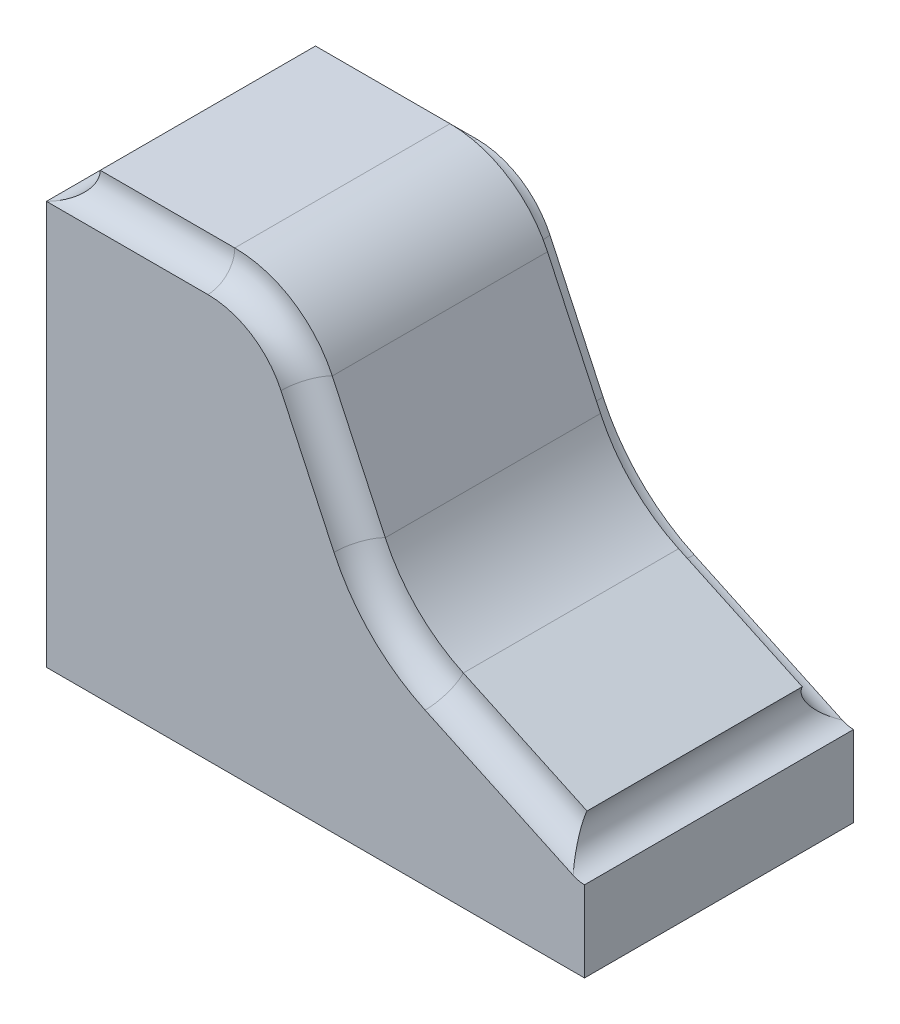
ISO-10303-21;
HEADER;
FILE_DESCRIPTION(('STEP AP214'),'2;1');
FILE_NAME('part.step','',(''),(''),'','','');
FILE_SCHEMA(('AUTOMOTIVE_DESIGN { 1 0 10303 214 1 1 1 1 }'));
ENDSEC;
DATA;
#1=APPLICATION_CONTEXT('core data for automotive mechanical design processes');
#2=APPLICATION_PROTOCOL_DEFINITION('international standard','automotive_design',2000,#1);
#3=PRODUCT_CONTEXT('',#1,'mechanical');
#4=PRODUCT('Part','Part','',(#3));
#5=PRODUCT_RELATED_PRODUCT_CATEGORY('part','',(#4));
#6=PRODUCT_DEFINITION_FORMATION('','',#4);
#7=PRODUCT_DEFINITION_CONTEXT('part definition',#1,'design');
#8=PRODUCT_DEFINITION('design','',#6,#7);
#9=PRODUCT_DEFINITION_SHAPE('','',#8);
#10=(LENGTH_UNIT() NAMED_UNIT(*) SI_UNIT(.MILLI.,.METRE.));
#11=(NAMED_UNIT(*) PLANE_ANGLE_UNIT() SI_UNIT($,.RADIAN.));
#12=(NAMED_UNIT(*) SI_UNIT($,.STERADIAN.) SOLID_ANGLE_UNIT());
#13=UNCERTAINTY_MEASURE_WITH_UNIT(LENGTH_MEASURE(1.E-05),#10,'distance_accuracy_value','');
#14=(GEOMETRIC_REPRESENTATION_CONTEXT(3) GLOBAL_UNCERTAINTY_ASSIGNED_CONTEXT((#13)) GLOBAL_UNIT_ASSIGNED_CONTEXT((#10,
#11,#12)) REPRESENTATION_CONTEXT('',''));
#15=CARTESIAN_POINT('',(0.,0.,0.));
#16=DIRECTION('',(0.,0.,1.));
#17=DIRECTION('',(1.,0.,0.));
#18=AXIS2_PLACEMENT_3D('',#15,#16,#17);
#19=CARTESIAN_POINT('',(0.,0.,63.5));
#20=DIRECTION('',(0.,1.,0.));
#21=DIRECTION('',(0.,0.,1.));
#22=AXIS2_PLACEMENT_3D('',#19,#20,#21);
#23=PLANE('',#22);
#24=DIRECTION('',(1.,0.,0.));
#25=VECTOR('',#24,1.);
#26=CARTESIAN_POINT('',(0.,0.,0.));
#27=LINE('',#26,#25);
#28=CARTESIAN_POINT('',(0.,0.,0.));
#29=VERTEX_POINT('',#28);
#30=CARTESIAN_POINT('',(127.,0.,0.));
#31=VERTEX_POINT('',#30);
#32=EDGE_CURVE('E172',#29,#31,#27,.T.);
#33=ORIENTED_EDGE('',*,*,#32,.T.);
#34=DIRECTION('',(0.,0.,-1.));
#35=VECTOR('',#34,1.);
#36=CARTESIAN_POINT('',(127.,0.,63.5));
#37=LINE('',#36,#35);
#38=CARTESIAN_POINT('',(127.,0.,63.5));
#39=VERTEX_POINT('',#38);
#40=EDGE_CURVE('E208',#39,#31,#37,.T.);
#41=ORIENTED_EDGE('',*,*,#40,.F.);
#42=DIRECTION('',(1.,0.,0.));
#43=VECTOR('',#42,1.);
#44=CARTESIAN_POINT('',(0.,0.,63.5));
#45=LINE('',#44,#43);
#46=CARTESIAN_POINT('',(0.,0.,63.5));
#47=VERTEX_POINT('',#46);
#48=EDGE_CURVE('E183',#47,#39,#45,.T.);
#49=ORIENTED_EDGE('',*,*,#48,.F.);
#50=DIRECTION('',(0.,0.,-1.));
#51=VECTOR('',#50,1.);
#52=CARTESIAN_POINT('',(0.,0.,63.5));
#53=LINE('',#52,#51);
#54=EDGE_CURVE('E191',#47,#29,#53,.T.);
#55=ORIENTED_EDGE('',*,*,#54,.T.);
#56=EDGE_LOOP('',(#33,#41,#49,#55));
#57=FACE_BOUND('',#56,.T.);
#58=ADVANCED_FACE('F44',(#57),#23,.F.);
#59=CARTESIAN_POINT('',(127.,0.,63.5));
#60=DIRECTION('',(-1.,0.,0.));
#61=DIRECTION('',(0.,0.,1.));
#62=AXIS2_PLACEMENT_3D('',#59,#60,#61);
#63=PLANE('',#62);
#64=DIRECTION('',(0.,1.,0.));
#65=VECTOR('',#64,1.);
#66=CARTESIAN_POINT('',(127.,0.,0.));
#67=LINE('',#66,#65);
#68=CARTESIAN_POINT('',(127.,19.05,0.));
#69=VERTEX_POINT('',#68);
#70=EDGE_CURVE('E176',#31,#69,#67,.T.);
#71=ORIENTED_EDGE('',*,*,#70,.T.);
#72=DIRECTION('',(0.,0.,1.));
#73=VECTOR('',#72,1.);
#74=CARTESIAN_POINT('',(127.,19.05,-14.0700000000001));
#75=LINE('',#74,#73);
#76=CARTESIAN_POINT('',(127.,19.05,63.5));
#77=VERTEX_POINT('',#76);
#78=EDGE_CURVE('E270',#69,#77,#75,.T.);
#79=ORIENTED_EDGE('',*,*,#78,.T.);
#80=DIRECTION('',(0.,1.,0.));
#81=VECTOR('',#80,1.);
#82=CARTESIAN_POINT('',(127.,0.,63.5));
#83=LINE('',#82,#81);
#84=EDGE_CURVE('E186',#39,#77,#83,.T.);
#85=ORIENTED_EDGE('',*,*,#84,.F.);
#86=ORIENTED_EDGE('',*,*,#40,.T.);
#87=EDGE_LOOP('',(#71,#79,#85,#86));
#88=FACE_BOUND('',#87,.T.);
#89=ADVANCED_FACE('F353',(#88),#63,.F.);
#90=CARTESIAN_POINT('',(0.,0.,63.5));
#91=DIRECTION('',(1.,0.,0.));
#92=DIRECTION('',(0.,0.,-1.));
#93=AXIS2_PLACEMENT_3D('',#90,#91,#92);
#94=PLANE('',#93);
#95=DIRECTION('',(0.,-1.,0.));
#96=VECTOR('',#95,1.);
#97=CARTESIAN_POINT('',(0.,0.,63.5));
#98=LINE('',#97,#96);
#99=CARTESIAN_POINT('',(0.,95.25,63.5));
#100=VERTEX_POINT('',#99);
#101=EDGE_CURVE('E190',#100,#47,#98,.T.);
#102=ORIENTED_EDGE('',*,*,#101,.F.);
#103=DIRECTION('',(0.,0.,-1.));
#104=VECTOR('',#103,1.);
#105=CARTESIAN_POINT('',(0.,95.25,77.5700000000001));
#106=LINE('',#105,#104);
#107=CARTESIAN_POINT('',(0.,95.25,0.));
#108=VERTEX_POINT('',#107);
#109=EDGE_CURVE('E249',#100,#108,#106,.T.);
#110=ORIENTED_EDGE('',*,*,#109,.T.);
#111=DIRECTION('',(0.,-1.,0.));
#112=VECTOR('',#111,1.);
#113=CARTESIAN_POINT('',(0.,0.,0.));
#114=LINE('',#113,#112);
#115=EDGE_CURVE('E187',#108,#29,#114,.T.);
#116=ORIENTED_EDGE('',*,*,#115,.T.);
#117=ORIENTED_EDGE('',*,*,#54,.F.);
#118=EDGE_LOOP('',(#102,#110,#116,#117));
#119=FACE_BOUND('',#118,.T.);
#120=ADVANCED_FACE('F334',(#119),#94,.F.);
#121=CARTESIAN_POINT('',(108.151485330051,76.2279054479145,63.5));
#122=DIRECTION('',(0.,0.,-1.));
#123=DIRECTION('',(-1.,0.,0.));
#124=AXIS2_PLACEMENT_3D('',#121,#122,#123);
#125=PLANE('',#124);
#126=ORIENTED_EDGE('',*,*,#84,.T.);
#127=CARTESIAN_POINT('',(127.,25.4,63.5));
#128=DIRECTION('',(0.,0.,-1.));
#129=DIRECTION('',(-1.,0.,0.));
#130=AXIS2_PLACEMENT_3D('',#127,#128,#129);
#131=CIRCLE('',#130,6.35);
#132=CARTESIAN_POINT('',(124.316374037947,19.6449455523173,63.5));
#133=VERTEX_POINT('',#132);
#134=EDGE_CURVE('E159',#77,#133,#131,.T.);
#135=ORIENTED_EDGE('',*,*,#134,.T.);
#136=DIRECTION('',(-0.906307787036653,0.422618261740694,0.));
#137=VECTOR('',#136,1.);
#138=CARTESIAN_POINT('',(137.068124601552,13.6987066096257,63.5));
#139=LINE('',#138,#137);
#140=CARTESIAN_POINT('',(89.3661035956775,35.9425243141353,63.5));
#141=VERTEX_POINT('',#140);
#142=EDGE_CURVE('E12',#133,#141,#139,.T.);
#143=ORIENTED_EDGE('',*,*,#142,.T.);
#144=CARTESIAN_POINT('',(108.151485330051,76.2279054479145,63.5));
#145=DIRECTION('',(0.,0.,-1.));
#146=DIRECTION('',(-1.,0.,0.));
#147=AXIS2_PLACEMENT_3D('',#144,#145,#146);
#148=CIRCLE('',#147,44.45);
#149=CARTESIAN_POINT('',(67.8661041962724,57.4425237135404,63.5));
#150=VERTEX_POINT('',#149);
#151=EDGE_CURVE('E51',#141,#150,#148,.T.);
#152=ORIENTED_EDGE('',*,*,#151,.T.);
#153=DIRECTION('',(-0.4226182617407,0.906307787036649,0.));
#154=VECTOR('',#153,1.);
#155=CARTESIAN_POINT('',(67.8661041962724,57.4425237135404,63.5));
#156=LINE('',#155,#154);
#157=CARTESIAN_POINT('',(55.3651633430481,84.2508778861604,63.5));
#158=VERTEX_POINT('',#157);
#159=EDGE_CURVE('E229',#150,#158,#156,.T.);
#160=ORIENTED_EDGE('',*,*,#159,.T.);
#161=CARTESIAN_POINT('',(38.1,76.2,63.5));
#162=DIRECTION('',(0.,0.,1.));
#163=DIRECTION('',(1.,0.,0.));
#164=AXIS2_PLACEMENT_3D('',#161,#162,#163);
#165=CIRCLE('',#164,19.05);
#166=CARTESIAN_POINT('',(38.0999999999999,95.25,63.5));
#167=VERTEX_POINT('',#166);
#168=EDGE_CURVE('E226',#158,#167,#165,.T.);
#169=ORIENTED_EDGE('',*,*,#168,.T.);
#170=DIRECTION('',(-1.,0.,0.));
#171=VECTOR('',#170,1.);
#172=CARTESIAN_POINT('',(38.1,95.25,63.5));
#173=LINE('',#172,#171);
#174=EDGE_CURVE('E223',#167,#100,#173,.T.);
#175=ORIENTED_EDGE('',*,*,#174,.T.);
#176=ORIENTED_EDGE('',*,*,#101,.T.);
#177=ORIENTED_EDGE('',*,*,#48,.T.);
#178=EDGE_LOOP('',(#126,#135,#143,#152,#160,#169,#175,#176,#177));
#179=FACE_BOUND('',#178,.T.);
#180=ADVANCED_FACE('F233',(#179),#125,.F.);
#181=CARTESIAN_POINT('',(108.151485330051,76.2279054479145,0.));
#182=DIRECTION('',(0.,0.,-1.));
#183=DIRECTION('',(-1.,0.,0.));
#184=AXIS2_PLACEMENT_3D('',#181,#182,#183);
#185=PLANE('',#184);
#186=CARTESIAN_POINT('',(127.,25.4,0.));
#187=DIRECTION('',(0.,0.,-1.));
#188=DIRECTION('',(-1.,0.,0.));
#189=AXIS2_PLACEMENT_3D('',#186,#187,#188);
#190=CIRCLE('',#189,6.35);
#191=CARTESIAN_POINT('',(124.316374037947,19.6449455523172,0.));
#192=VERTEX_POINT('',#191);
#193=EDGE_CURVE('E221',#69,#192,#190,.T.);
#194=ORIENTED_EDGE('',*,*,#193,.F.);
#195=ORIENTED_EDGE('',*,*,#70,.F.);
#196=ORIENTED_EDGE('',*,*,#32,.F.);
#197=ORIENTED_EDGE('',*,*,#115,.F.);
#198=DIRECTION('',(1.,0.,0.));
#199=VECTOR('',#198,1.);
#200=CARTESIAN_POINT('',(-14.0700000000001,95.25,0.));
#201=LINE('',#200,#199);
#202=CARTESIAN_POINT('',(38.1000000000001,95.25,0.));
#203=VERTEX_POINT('',#202);
#204=EDGE_CURVE('E219',#203,#108,#201,.F.);
#205=ORIENTED_EDGE('',*,*,#204,.F.);
#206=CARTESIAN_POINT('',(38.1,76.2,0.));
#207=DIRECTION('',(0.,0.,1.));
#208=DIRECTION('',(1.,0.,0.));
#209=AXIS2_PLACEMENT_3D('',#206,#207,#208);
#210=CIRCLE('',#209,19.05);
#211=CARTESIAN_POINT('',(55.3651633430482,84.2508778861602,0.));
#212=VERTEX_POINT('',#211);
#213=EDGE_CURVE('E217',#212,#203,#210,.T.);
#214=ORIENTED_EDGE('',*,*,#213,.F.);
#215=DIRECTION('',(0.4226182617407,-0.906307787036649,0.));
#216=VECTOR('',#215,1.);
#217=CARTESIAN_POINT('',(55.3651633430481,84.2508778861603,0.));
#218=LINE('',#217,#216);
#219=CARTESIAN_POINT('',(67.8661041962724,57.4425237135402,0.));
#220=VERTEX_POINT('',#219);
#221=EDGE_CURVE('E215',#220,#212,#218,.F.);
#222=ORIENTED_EDGE('',*,*,#221,.F.);
#223=CARTESIAN_POINT('',(108.151485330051,76.2279054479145,0.));
#224=DIRECTION('',(0.,0.,-1.));
#225=DIRECTION('',(-1.,0.,0.));
#226=AXIS2_PLACEMENT_3D('',#223,#224,#225);
#227=CIRCLE('',#226,44.45);
#228=CARTESIAN_POINT('',(89.3661035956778,35.9425243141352,0.));
#229=VERTEX_POINT('',#228);
#230=EDGE_CURVE('E213',#229,#220,#227,.T.);
#231=ORIENTED_EDGE('',*,*,#230,.F.);
#232=DIRECTION('',(0.906307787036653,-0.422618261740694,0.));
#233=VECTOR('',#232,1.);
#234=CARTESIAN_POINT('',(89.3661035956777,35.9425243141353,0.));
#235=LINE('',#234,#233);
#236=EDGE_CURVE('E211',#192,#229,#235,.F.);
#237=ORIENTED_EDGE('',*,*,#236,.F.);
#238=EDGE_LOOP('',(#194,#195,#196,#197,#205,#214,#222,#231,#237));
#239=FACE_BOUND('',#238,.T.);
#240=ADVANCED_FACE('F328',(#239),#185,.T.);
#241=CARTESIAN_POINT('',(139.751750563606,19.4537610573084,63.5));
#242=DIRECTION('',(-0.906307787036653,0.422618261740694,0.));
#243=DIRECTION('',(-0.422618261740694,-0.906307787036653,0.));
#244=AXIS2_PLACEMENT_3D('',#241,#242,#243);
#245=CYLINDRICAL_SURFACE('',#244,6.35);
#246=CARTESIAN_POINT('',(92.049729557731,41.697578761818,63.5));
#247=DIRECTION('',(-0.906307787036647,0.422618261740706,0.));
#248=DIRECTION('',(0.422618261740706,0.906307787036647,0.));
#249=AXIS2_PLACEMENT_3D('',#246,#247,#248);
#250=CIRCLE('',#249,6.35);
#251=CARTESIAN_POINT('',(92.049729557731,41.697578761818,57.15));
#252=VERTEX_POINT('',#251);
#253=EDGE_CURVE('E237',#252,#141,#250,.T.);
#254=ORIENTED_EDGE('',*,*,#253,.T.);
#255=ORIENTED_EDGE('',*,*,#142,.F.);
#256=CARTESIAN_POINT('',(127.,25.4,63.5));
#257=DIRECTION('',(-0.64085638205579,0.298836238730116,0.707106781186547));
#258=DIRECTION('',(-0.64085638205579,0.298836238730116,-0.707106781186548));
#259=AXIS2_PLACEMENT_3D('',#256,#257,#258);
#260=ELLIPSE('',#259,8.98025612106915,6.35);
#261=CARTESIAN_POINT('',(121.244945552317,28.0836259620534,57.15));
#262=VERTEX_POINT('',#261);
#263=EDGE_CURVE('E153',#133,#262,#260,.F.);
#264=ORIENTED_EDGE('',*,*,#263,.T.);
#265=DIRECTION('',(-0.906307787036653,0.422618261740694,0.));
#266=VECTOR('',#265,1.);
#267=CARTESIAN_POINT('',(139.751750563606,19.4537610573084,57.15));
#268=LINE('',#267,#266);
#269=EDGE_CURVE('E164',#252,#262,#268,.F.);
#270=ORIENTED_EDGE('',*,*,#269,.F.);
#271=EDGE_LOOP('',(#254,#255,#264,#270));
#272=FACE_BOUND('',#271,.T.);
#273=ADVANCED_FACE('F163',(#272),#245,.F.);
#274=CARTESIAN_POINT('',(108.151485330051,76.2279054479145,63.5));
#275=DIRECTION('',(0.,0.,-1.));
#276=DIRECTION('',(-1.,0.,0.));
#277=AXIS2_PLACEMENT_3D('',#274,#275,#276);
#278=TOROIDAL_SURFACE('',#277,38.1,6.35);
#279=CARTESIAN_POINT('',(73.6211586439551,60.1261496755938,63.5));
#280=DIRECTION('',(-0.422618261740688,0.906307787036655,0.));
#281=DIRECTION('',(0.906307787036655,0.422618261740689,0.));
#282=AXIS2_PLACEMENT_3D('',#279,#280,#281);
#283=CIRCLE('',#282,6.35);
#284=CARTESIAN_POINT('',(73.6211586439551,60.1261496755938,57.15));
#285=VERTEX_POINT('',#284);
#286=EDGE_CURVE('E239',#285,#150,#283,.T.);
#287=ORIENTED_EDGE('',*,*,#286,.T.);
#288=ORIENTED_EDGE('',*,*,#151,.F.);
#289=ORIENTED_EDGE('',*,*,#253,.F.);
#290=CARTESIAN_POINT('',(108.151485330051,76.2279054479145,57.15));
#291=DIRECTION('',(0.,0.,1.));
#292=DIRECTION('',(1.,0.,0.));
#293=AXIS2_PLACEMENT_3D('',#290,#291,#292);
#294=CIRCLE('',#293,38.1);
#295=EDGE_CURVE('E173',#285,#252,#294,.T.);
#296=ORIENTED_EDGE('',*,*,#295,.F.);
#297=EDGE_LOOP('',(#287,#288,#289,#296));
#298=FACE_BOUND('',#297,.T.);
#299=ADVANCED_FACE('F236',(#298),#278,.F.);
#300=CARTESIAN_POINT('',(73.6211586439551,60.1261496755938,63.5));
#301=DIRECTION('',(-0.4226182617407,0.906307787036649,0.));
#302=DIRECTION('',(-0.906307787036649,-0.4226182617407,0.));
#303=AXIS2_PLACEMENT_3D('',#300,#301,#302);
#304=CYLINDRICAL_SURFACE('',#303,6.35);
#305=CARTESIAN_POINT('',(61.1202177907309,86.9345038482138,63.5));
#306=DIRECTION('',(-0.422618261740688,0.906307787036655,0.));
#307=DIRECTION('',(0.906307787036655,0.422618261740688,0.));
#308=AXIS2_PLACEMENT_3D('',#305,#306,#307);
#309=CIRCLE('',#308,6.35);
#310=CARTESIAN_POINT('',(61.1202177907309,86.9345038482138,57.15));
#311=VERTEX_POINT('',#310);
#312=EDGE_CURVE('E241',#311,#158,#309,.T.);
#313=ORIENTED_EDGE('',*,*,#312,.T.);
#314=ORIENTED_EDGE('',*,*,#159,.F.);
#315=ORIENTED_EDGE('',*,*,#286,.F.);
#316=DIRECTION('',(-0.4226182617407,0.906307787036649,0.));
#317=VECTOR('',#316,1.);
#318=CARTESIAN_POINT('',(73.6211586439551,60.1261496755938,57.15));
#319=LINE('',#318,#317);
#320=EDGE_CURVE('E179',#311,#285,#319,.F.);
#321=ORIENTED_EDGE('',*,*,#320,.F.);
#322=EDGE_LOOP('',(#313,#314,#315,#321));
#323=FACE_BOUND('',#322,.T.);
#324=ADVANCED_FACE('F343',(#323),#304,.F.);
#325=CARTESIAN_POINT('',(38.1,76.2,63.5));
#326=DIRECTION('',(0.,0.,1.));
#327=DIRECTION('',(1.,0.,0.));
#328=AXIS2_PLACEMENT_3D('',#325,#326,#327);
#329=TOROIDAL_SURFACE('',#328,25.4,6.35);
#330=CARTESIAN_POINT('',(38.1,101.6,63.5));
#331=DIRECTION('',(-1.,0.,0.));
#332=DIRECTION('',(0.,1.,0.));
#333=AXIS2_PLACEMENT_3D('',#330,#331,#332);
#334=CIRCLE('',#333,6.35);
#335=CARTESIAN_POINT('',(38.1,101.6,57.15));
#336=VERTEX_POINT('',#335);
#337=EDGE_CURVE('E166',#336,#167,#334,.T.);
#338=ORIENTED_EDGE('',*,*,#337,.T.);
#339=ORIENTED_EDGE('',*,*,#168,.F.);
#340=ORIENTED_EDGE('',*,*,#312,.F.);
#341=CARTESIAN_POINT('',(38.1,76.2,57.15));
#342=DIRECTION('',(0.,0.,1.));
#343=DIRECTION('',(1.,0.,0.));
#344=AXIS2_PLACEMENT_3D('',#341,#342,#343);
#345=CIRCLE('',#344,25.4);
#346=EDGE_CURVE('E276',#336,#311,#345,.F.);
#347=ORIENTED_EDGE('',*,*,#346,.F.);
#348=EDGE_LOOP('',(#338,#339,#340,#347));
#349=FACE_BOUND('',#348,.T.);
#350=ADVANCED_FACE('F342',(#349),#329,.F.);
#351=CARTESIAN_POINT('',(38.1,101.6,63.5));
#352=DIRECTION('',(-1.,0.,0.));
#353=DIRECTION('',(0.,0.,1.));
#354=AXIS2_PLACEMENT_3D('',#351,#352,#353);
#355=CYLINDRICAL_SURFACE('',#354,6.35);
#356=CARTESIAN_POINT('',(0.,101.6,63.5));
#357=DIRECTION('',(-0.707106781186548,0.,-0.707106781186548));
#358=DIRECTION('',(0.707106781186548,0.,-0.707106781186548));
#359=AXIS2_PLACEMENT_3D('',#356,#357,#358);
#360=ELLIPSE('',#359,8.98025612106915,6.35);
#361=CARTESIAN_POINT('',(6.35,101.6,57.15));
#362=VERTEX_POINT('',#361);
#363=EDGE_CURVE('E58',#100,#362,#360,.F.);
#364=ORIENTED_EDGE('',*,*,#363,.F.);
#365=ORIENTED_EDGE('',*,*,#174,.F.);
#366=ORIENTED_EDGE('',*,*,#337,.F.);
#367=DIRECTION('',(-1.,0.,0.));
#368=VECTOR('',#367,1.);
#369=CARTESIAN_POINT('',(38.1,101.6,57.15));
#370=LINE('',#369,#368);
#371=EDGE_CURVE('E158',#362,#336,#370,.F.);
#372=ORIENTED_EDGE('',*,*,#371,.F.);
#373=EDGE_LOOP('',(#364,#365,#366,#372));
#374=FACE_BOUND('',#373,.T.);
#375=ADVANCED_FACE('F340',(#374),#355,.F.);
#376=CARTESIAN_POINT('',(127.,25.4,-14.0700000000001));
#377=DIRECTION('',(0.,0.,1.));
#378=DIRECTION('',(1.,0.,0.));
#379=AXIS2_PLACEMENT_3D('',#376,#377,#378);
#380=CYLINDRICAL_SURFACE('',#379,6.35);
#381=ORIENTED_EDGE('',*,*,#263,.F.);
#382=ORIENTED_EDGE('',*,*,#134,.F.);
#383=ORIENTED_EDGE('',*,*,#78,.F.);
#384=ORIENTED_EDGE('',*,*,#193,.T.);
#385=CARTESIAN_POINT('',(127.,25.4,0.));
#386=DIRECTION('',(0.64085638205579,-0.298836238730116,0.707106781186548));
#387=DIRECTION('',(0.640856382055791,-0.298836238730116,-0.707106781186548));
#388=AXIS2_PLACEMENT_3D('',#385,#386,#387);
#389=ELLIPSE('',#388,8.98025612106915,6.35);
#390=CARTESIAN_POINT('',(121.244945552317,28.0836259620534,6.34999999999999));
#391=VERTEX_POINT('',#390);
#392=EDGE_CURVE('E66',#192,#391,#389,.F.);
#393=ORIENTED_EDGE('',*,*,#392,.T.);
#394=DIRECTION('',(0.,0.,1.));
#395=VECTOR('',#394,1.);
#396=CARTESIAN_POINT('',(121.244945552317,28.0836259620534,-14.0700000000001));
#397=LINE('',#396,#395);
#398=EDGE_CURVE('E150',#262,#391,#397,.F.);
#399=ORIENTED_EDGE('',*,*,#398,.F.);
#400=EDGE_LOOP('',(#381,#382,#383,#384,#393,#399));
#401=FACE_BOUND('',#400,.T.);
#402=ADVANCED_FACE('F152',(#401),#380,.F.);
#403=CARTESIAN_POINT('',(-14.0700000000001,101.6,0.));
#404=DIRECTION('',(1.,0.,0.));
#405=DIRECTION('',(0.,0.,-1.));
#406=AXIS2_PLACEMENT_3D('',#403,#404,#405);
#407=CYLINDRICAL_SURFACE('',#406,6.35);
#408=CARTESIAN_POINT('',(38.1,101.6,0.));
#409=DIRECTION('',(1.,0.,0.));
#410=DIRECTION('',(0.,1.,0.));
#411=AXIS2_PLACEMENT_3D('',#408,#409,#410);
#412=CIRCLE('',#411,6.35);
#413=CARTESIAN_POINT('',(38.1,101.6,6.34999999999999));
#414=VERTEX_POINT('',#413);
#415=EDGE_CURVE('E303',#414,#203,#412,.T.);
#416=ORIENTED_EDGE('',*,*,#415,.T.);
#417=ORIENTED_EDGE('',*,*,#204,.T.);
#418=CARTESIAN_POINT('',(0.,101.6,0.));
#419=DIRECTION('',(0.707106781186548,0.,-0.707106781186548));
#420=DIRECTION('',(-0.707106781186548,0.,-0.707106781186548));
#421=AXIS2_PLACEMENT_3D('',#418,#419,#420);
#422=ELLIPSE('',#421,8.98025612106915,6.35);
#423=CARTESIAN_POINT('',(6.35,101.6,6.34999999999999));
#424=VERTEX_POINT('',#423);
#425=EDGE_CURVE('E253',#108,#424,#422,.F.);
#426=ORIENTED_EDGE('',*,*,#425,.T.);
#427=DIRECTION('',(1.,0.,0.));
#428=VECTOR('',#427,1.);
#429=CARTESIAN_POINT('',(-14.0700000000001,101.6,6.34999999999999));
#430=LINE('',#429,#428);
#431=EDGE_CURVE('E267',#414,#424,#430,.F.);
#432=ORIENTED_EDGE('',*,*,#431,.F.);
#433=EDGE_LOOP('',(#416,#417,#426,#432));
#434=FACE_BOUND('',#433,.T.);
#435=ADVANCED_FACE('F313',(#434),#407,.F.);
#436=CARTESIAN_POINT('',(38.1,76.2,0.));
#437=DIRECTION('',(0.,0.,-1.));
#438=DIRECTION('',(-1.,0.,0.));
#439=AXIS2_PLACEMENT_3D('',#436,#437,#438);
#440=TOROIDAL_SURFACE('',#439,25.4,6.35);
#441=CARTESIAN_POINT('',(61.1202177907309,86.9345038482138,0.));
#442=DIRECTION('',(0.422618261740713,-0.906307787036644,0.));
#443=DIRECTION('',(0.906307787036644,0.422618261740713,0.));
#444=AXIS2_PLACEMENT_3D('',#441,#442,#443);
#445=CIRCLE('',#444,6.35);
#446=CARTESIAN_POINT('',(61.1202177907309,86.9345038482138,6.34999999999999));
#447=VERTEX_POINT('',#446);
#448=EDGE_CURVE('E300',#447,#212,#445,.T.);
#449=ORIENTED_EDGE('',*,*,#448,.T.);
#450=ORIENTED_EDGE('',*,*,#213,.T.);
#451=ORIENTED_EDGE('',*,*,#415,.F.);
#452=CARTESIAN_POINT('',(38.1,76.2,6.34999999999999));
#453=DIRECTION('',(0.,0.,-1.));
#454=DIRECTION('',(-1.,0.,0.));
#455=AXIS2_PLACEMENT_3D('',#452,#453,#454);
#456=CIRCLE('',#455,25.4);
#457=EDGE_CURVE('E264',#447,#414,#456,.F.);
#458=ORIENTED_EDGE('',*,*,#457,.F.);
#459=EDGE_LOOP('',(#449,#450,#451,#458));
#460=FACE_BOUND('',#459,.T.);
#461=ADVANCED_FACE('F321',(#460),#440,.F.);
#462=CARTESIAN_POINT('',(61.1202177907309,86.9345038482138,0.));
#463=DIRECTION('',(0.4226182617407,-0.906307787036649,0.));
#464=DIRECTION('',(0.906307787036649,0.4226182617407,0.));
#465=AXIS2_PLACEMENT_3D('',#462,#463,#464);
#466=CYLINDRICAL_SURFACE('',#465,6.35);
#467=CARTESIAN_POINT('',(73.6211586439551,60.1261496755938,0.));
#468=DIRECTION('',(0.422618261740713,-0.906307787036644,0.));
#469=DIRECTION('',(0.906307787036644,0.422618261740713,0.));
#470=AXIS2_PLACEMENT_3D('',#467,#468,#469);
#471=CIRCLE('',#470,6.35);
#472=CARTESIAN_POINT('',(73.6211586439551,60.1261496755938,6.34999999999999));
#473=VERTEX_POINT('',#472);
#474=EDGE_CURVE('E295',#473,#220,#471,.T.);
#475=ORIENTED_EDGE('',*,*,#474,.T.);
#476=ORIENTED_EDGE('',*,*,#221,.T.);
#477=ORIENTED_EDGE('',*,*,#448,.F.);
#478=DIRECTION('',(0.4226182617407,-0.906307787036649,0.));
#479=VECTOR('',#478,1.);
#480=CARTESIAN_POINT('',(61.1202177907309,86.9345038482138,6.34999999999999));
#481=LINE('',#480,#479);
#482=EDGE_CURVE('E261',#473,#447,#481,.F.);
#483=ORIENTED_EDGE('',*,*,#482,.F.);
#484=EDGE_LOOP('',(#475,#476,#477,#483));
#485=FACE_BOUND('',#484,.T.);
#486=ADVANCED_FACE('F324',(#485),#466,.F.);
#487=CARTESIAN_POINT('',(108.151485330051,76.2279054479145,0.));
#488=DIRECTION('',(0.,0.,1.));
#489=DIRECTION('',(1.,0.,0.));
#490=AXIS2_PLACEMENT_3D('',#487,#488,#489);
#491=TOROIDAL_SURFACE('',#490,38.1,6.35);
#492=CARTESIAN_POINT('',(92.0497295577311,41.697578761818,0.));
#493=DIRECTION('',(0.906307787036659,-0.422618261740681,0.));
#494=DIRECTION('',(0.422618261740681,0.906307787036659,0.));
#495=AXIS2_PLACEMENT_3D('',#492,#493,#494);
#496=CIRCLE('',#495,6.35);
#497=CARTESIAN_POINT('',(92.0497295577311,41.697578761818,6.34999999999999));
#498=VERTEX_POINT('',#497);
#499=EDGE_CURVE('E292',#498,#229,#496,.T.);
#500=ORIENTED_EDGE('',*,*,#499,.T.);
#501=ORIENTED_EDGE('',*,*,#230,.T.);
#502=ORIENTED_EDGE('',*,*,#474,.F.);
#503=CARTESIAN_POINT('',(108.151485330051,76.2279054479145,6.34999999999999));
#504=DIRECTION('',(0.,0.,-1.));
#505=DIRECTION('',(-1.,0.,0.));
#506=AXIS2_PLACEMENT_3D('',#503,#504,#505);
#507=CIRCLE('',#506,38.1);
#508=EDGE_CURVE('E258',#498,#473,#507,.T.);
#509=ORIENTED_EDGE('',*,*,#508,.F.);
#510=EDGE_LOOP('',(#500,#501,#502,#509));
#511=FACE_BOUND('',#510,.T.);
#512=ADVANCED_FACE('F291',(#511),#491,.F.);
#513=CARTESIAN_POINT('',(92.0497295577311,41.697578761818,0.));
#514=DIRECTION('',(0.906307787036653,-0.422618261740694,0.));
#515=DIRECTION('',(0.422618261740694,0.906307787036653,0.));
#516=AXIS2_PLACEMENT_3D('',#513,#514,#515);
#517=CYLINDRICAL_SURFACE('',#516,6.35);
#518=ORIENTED_EDGE('',*,*,#392,.F.);
#519=ORIENTED_EDGE('',*,*,#236,.T.);
#520=ORIENTED_EDGE('',*,*,#499,.F.);
#521=DIRECTION('',(0.906307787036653,-0.422618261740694,0.));
#522=VECTOR('',#521,1.);
#523=CARTESIAN_POINT('',(92.0497295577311,41.697578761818,6.34999999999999));
#524=LINE('',#523,#522);
#525=EDGE_CURVE('E256',#391,#498,#524,.F.);
#526=ORIENTED_EDGE('',*,*,#525,.F.);
#527=EDGE_LOOP('',(#518,#519,#520,#526));
#528=FACE_BOUND('',#527,.T.);
#529=ADVANCED_FACE('F296',(#528),#517,.F.);
#530=CARTESIAN_POINT('',(0.,101.6,77.5700000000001));
#531=DIRECTION('',(0.,0.,-1.));
#532=DIRECTION('',(-1.,0.,0.));
#533=AXIS2_PLACEMENT_3D('',#530,#531,#532);
#534=CYLINDRICAL_SURFACE('',#533,6.35);
#535=ORIENTED_EDGE('',*,*,#425,.F.);
#536=ORIENTED_EDGE('',*,*,#109,.F.);
#537=ORIENTED_EDGE('',*,*,#363,.T.);
#538=DIRECTION('',(0.,0.,-1.));
#539=VECTOR('',#538,1.);
#540=CARTESIAN_POINT('',(6.35,101.6,77.5700000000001));
#541=LINE('',#540,#539);
#542=EDGE_CURVE('E252',#424,#362,#541,.F.);
#543=ORIENTED_EDGE('',*,*,#542,.F.);
#544=EDGE_LOOP('',(#535,#536,#537,#543));
#545=FACE_BOUND('',#544,.T.);
#546=ADVANCED_FACE('F372',(#545),#534,.F.);
#547=CARTESIAN_POINT('',(38.1,101.6,63.5));
#548=DIRECTION('',(0.,-1.,0.));
#549=DIRECTION('',(0.,0.,-1.));
#550=AXIS2_PLACEMENT_3D('',#547,#548,#549);
#551=PLANE('',#550);
#552=ORIENTED_EDGE('',*,*,#542,.T.);
#553=ORIENTED_EDGE('',*,*,#371,.T.);
#554=DIRECTION('',(0.,0.,-1.));
#555=VECTOR('',#554,1.);
#556=CARTESIAN_POINT('',(38.1,101.6,63.5));
#557=LINE('',#556,#555);
#558=EDGE_CURVE('E198',#336,#414,#557,.T.);
#559=ORIENTED_EDGE('',*,*,#558,.T.);
#560=ORIENTED_EDGE('',*,*,#431,.T.);
#561=EDGE_LOOP('',(#552,#553,#559,#560));
#562=FACE_BOUND('',#561,.T.);
#563=ADVANCED_FACE('F315',(#562),#551,.F.);
#564=CARTESIAN_POINT('',(38.1,76.2,63.5));
#565=DIRECTION('',(0.,0.,-1.));
#566=DIRECTION('',(-1.,0.,0.));
#567=AXIS2_PLACEMENT_3D('',#564,#565,#566);
#568=CYLINDRICAL_SURFACE('',#567,25.4);
#569=ORIENTED_EDGE('',*,*,#558,.F.);
#570=ORIENTED_EDGE('',*,*,#346,.T.);
#571=DIRECTION('',(0.,0.,-1.));
#572=VECTOR('',#571,1.);
#573=CARTESIAN_POINT('',(61.1202177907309,86.9345038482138,63.5));
#574=LINE('',#573,#572);
#575=EDGE_CURVE('E201',#311,#447,#574,.T.);
#576=ORIENTED_EDGE('',*,*,#575,.T.);
#577=ORIENTED_EDGE('',*,*,#457,.T.);
#578=EDGE_LOOP('',(#569,#570,#576,#577));
#579=FACE_BOUND('',#578,.T.);
#580=ADVANCED_FACE('F318',(#579),#568,.T.);
#581=CARTESIAN_POINT('',(73.6211586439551,60.1261496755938,63.5));
#582=DIRECTION('',(-0.90630778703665,-0.4226182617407,0.));
#583=DIRECTION('',(0.4226182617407,-0.90630778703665,0.));
#584=AXIS2_PLACEMENT_3D('',#581,#582,#583);
#585=PLANE('',#584);
#586=ORIENTED_EDGE('',*,*,#575,.F.);
#587=ORIENTED_EDGE('',*,*,#320,.T.);
#588=DIRECTION('',(0.,0.,-1.));
#589=VECTOR('',#588,1.);
#590=CARTESIAN_POINT('',(73.6211586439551,60.1261496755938,63.5));
#591=LINE('',#590,#589);
#592=EDGE_CURVE('E204',#285,#473,#591,.T.);
#593=ORIENTED_EDGE('',*,*,#592,.T.);
#594=ORIENTED_EDGE('',*,*,#482,.T.);
#595=EDGE_LOOP('',(#586,#587,#593,#594));
#596=FACE_BOUND('',#595,.T.);
#597=ADVANCED_FACE('F282',(#596),#585,.F.);
#598=CARTESIAN_POINT('',(108.151485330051,76.2279054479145,63.5));
#599=DIRECTION('',(0.,0.,-1.));
#600=DIRECTION('',(-1.,0.,0.));
#601=AXIS2_PLACEMENT_3D('',#598,#599,#600);
#602=CYLINDRICAL_SURFACE('',#601,38.1);
#603=ORIENTED_EDGE('',*,*,#592,.F.);
#604=ORIENTED_EDGE('',*,*,#295,.T.);
#605=DIRECTION('',(0.,0.,-1.));
#606=VECTOR('',#605,1.);
#607=CARTESIAN_POINT('',(92.0497295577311,41.697578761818,63.5));
#608=LINE('',#607,#606);
#609=EDGE_CURVE('E171',#252,#498,#608,.T.);
#610=ORIENTED_EDGE('',*,*,#609,.T.);
#611=ORIENTED_EDGE('',*,*,#508,.T.);
#612=EDGE_LOOP('',(#603,#604,#610,#611));
#613=FACE_BOUND('',#612,.T.);
#614=ADVANCED_FACE('F286',(#613),#602,.F.);
#615=CARTESIAN_POINT('',(127.,25.4,63.5));
#616=DIRECTION('',(-0.422618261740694,-0.906307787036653,0.));
#617=DIRECTION('',(0.906307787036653,-0.422618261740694,0.));
#618=AXIS2_PLACEMENT_3D('',#615,#616,#617);
#619=PLANE('',#618);
#620=ORIENTED_EDGE('',*,*,#609,.F.);
#621=ORIENTED_EDGE('',*,*,#269,.T.);
#622=ORIENTED_EDGE('',*,*,#398,.T.);
#623=ORIENTED_EDGE('',*,*,#525,.T.);
#624=EDGE_LOOP('',(#620,#621,#622,#623));
#625=FACE_BOUND('',#624,.T.);
#626=ADVANCED_FACE('F169',(#625),#619,.F.);
#627=CLOSED_SHELL('',(#58,#89,#120,#180,#240,#273,#299,#324,#350,#375,#402,#435,#461,#486,#512,
#529,#546,#563,#580,#597,#614,#626));
#628=MANIFOLD_SOLID_BREP('B2',#627);
#629=ADVANCED_BREP_SHAPE_REPRESENTATION('',(#18,#628),#14);
#630=SHAPE_DEFINITION_REPRESENTATION(#9,#629);
ENDSEC;
END-ISO-10303-21;
